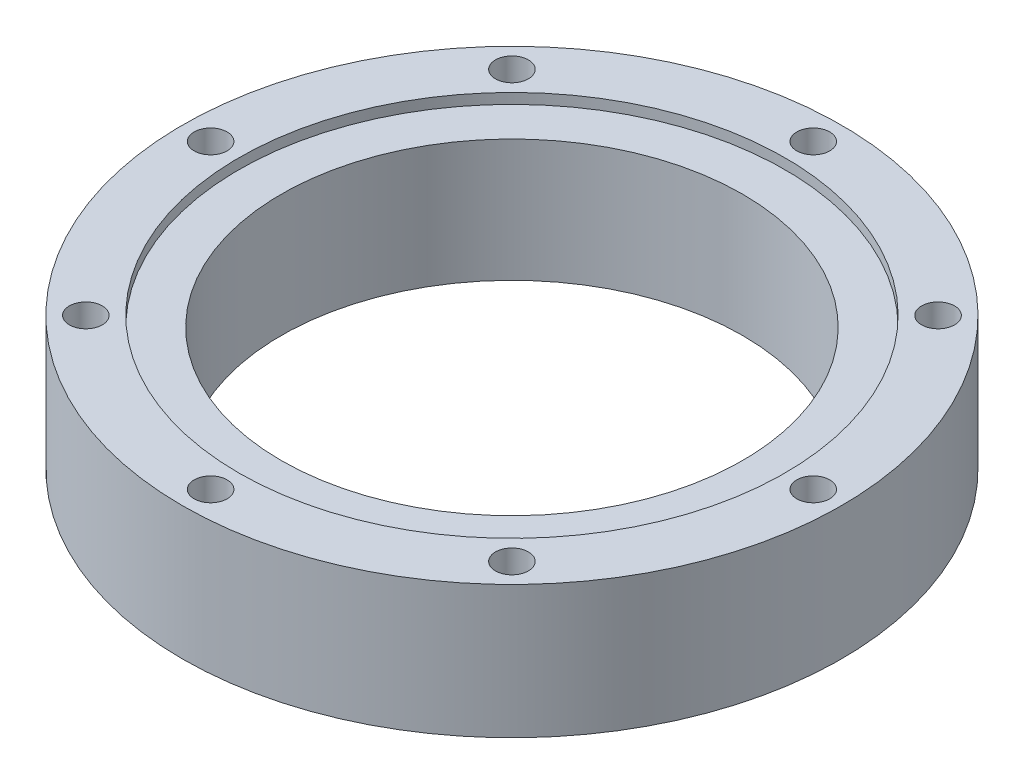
from build123d import *

# Parameters (mm, degrees)
SKETCH1_R           = 35
SKETCH1_R_2         = 29
BOSS_EXTRUDE1_DEPTH = 14.1
SKETCH2_R           = 1.75
CUT_EXTRUDE1_DEPTH  = 52.466591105
SKETCH3_R           = 29
SKETCH3_R_2         = 24.5
BOSS_EXTRUDE2_DEPTH = 13
SKETCH4_R           = 1.5
CUT_EXTRUDE2_DEPTH  = 5


with BuildPart() as part:
    # Sketch1 → Boss-Extrude1 (new body)
    with BuildSketch(Plane(origin=(0, 0, 0), x_dir=(1, 0, 0), z_dir=(0, 1, 0))):
        with Locations(Location((0, 0, 0), (0, 0, 270))):
            Circle(SKETCH1_R)
        with Locations(Location((0, 0, 0), (0, 0, 270))):
            Circle(SKETCH1_R_2, mode=Mode.SUBTRACT)
    extrude(amount=BOSS_EXTRUDE1_DEPTH)

    # Sketch2 → Cut-Extrude1 (cut, through all)
    with BuildSketch(Plane(origin=(0, 14.1, 0), x_dir=(1, 0, 0), z_dir=(0, 1, 0))):
        with Locations(Location((0, 32, 0), (0, 0, 270))):
            Circle(SKETCH2_R)
        with Locations(Location((22.627416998, 22.627416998, 0), (0, 0, 270))):
            Circle(SKETCH2_R)
        with Locations(Location((32, 0, 0), (0, 0, 270))):
            Circle(SKETCH2_R)
        with Locations(Location((22.627416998, -22.627416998, 0), (0, 0, 270))):
            Circle(SKETCH2_R)
        with Locations(Location((0, -32, 0), (0, 0, 270))):
            Circle(SKETCH2_R)
        with Locations(Location((-22.627416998, -22.627416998, 0), (0, 0, 270))):
            Circle(SKETCH2_R)
        with Locations(Location((-32, 0, 0), (0, 0, 270))):
            Circle(SKETCH2_R)
        with Locations(Location((-22.627416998, 22.627416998, 0), (0, 0, 270))):
            Circle(SKETCH2_R)
    extrude(amount=-CUT_EXTRUDE1_DEPTH, mode=Mode.SUBTRACT)

    # Sketch3 → Boss-Extrude2 (add)
    with BuildSketch(Plane(origin=(0, 0, 0), x_dir=(1, 0, 0), z_dir=(0, 1, 0))):
        with Locations(Location((0, 0, 0), (0, 0, 270))):
            Circle(SKETCH3_R)
        with Locations(Location((0, 0, 0), (0, 0, 90))):
            Circle(SKETCH3_R_2, mode=Mode.SUBTRACT)
    extrude(amount=BOSS_EXTRUDE2_DEPTH)

    # Sketch4 → Cut-Extrude2 (cut)
    with BuildSketch(Plane(origin=(0, 0, 0), x_dir=(-1, 0, 0), z_dir=(0, -1, 0))):
        with Locations(Location((-29.56414504, -12.245869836, 0), (0, 0, 90))):
            Circle(SKETCH4_R)
        with Locations(Location((29.56414504, 12.245869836, 0), (0, 0, 90))):
            Circle(SKETCH4_R)
    extrude(amount=-CUT_EXTRUDE2_DEPTH, mode=Mode.SUBTRACT)


solid = part.part
